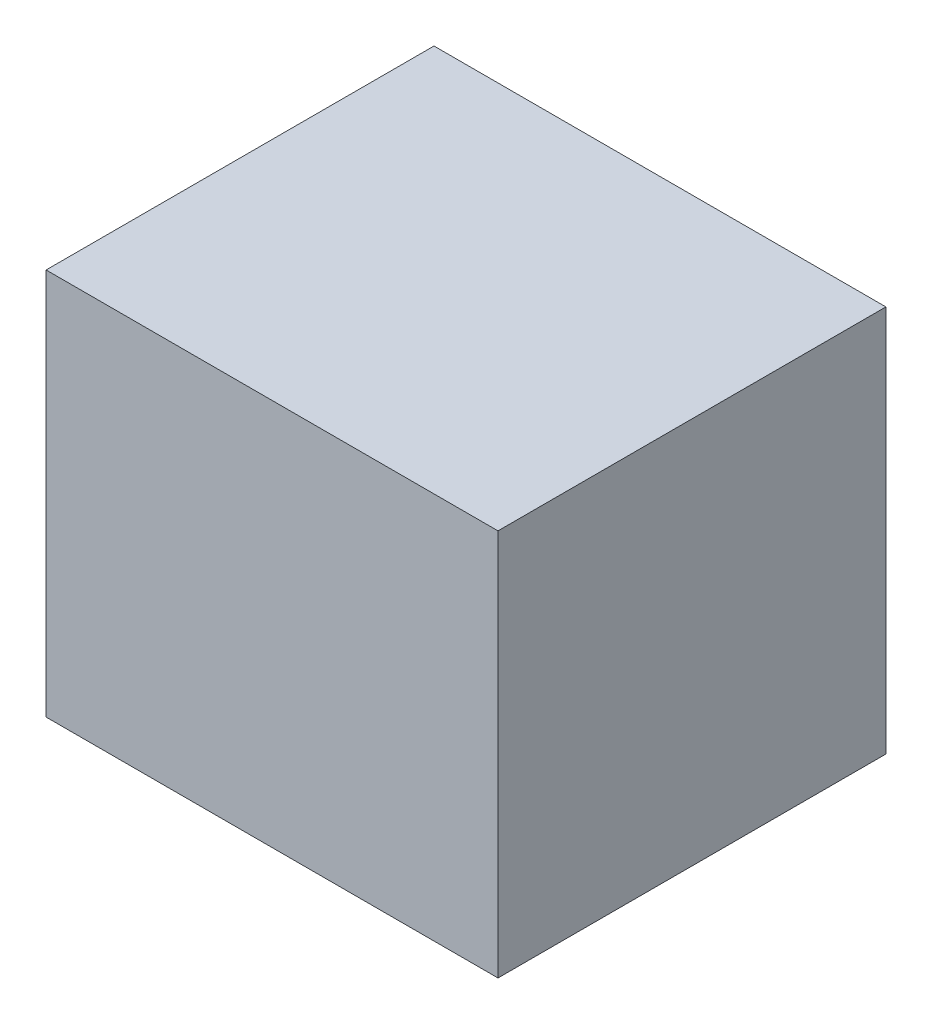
ISO-10303-21;
HEADER;
FILE_DESCRIPTION(('STEP AP214'),'2;1');
FILE_NAME('part.step','',(''),(''),'','','');
FILE_SCHEMA(('AUTOMOTIVE_DESIGN { 1 0 10303 214 1 1 1 1 }'));
ENDSEC;
DATA;
#1=APPLICATION_CONTEXT('core data for automotive mechanical design processes');
#2=APPLICATION_PROTOCOL_DEFINITION('international standard','automotive_design',2000,#1);
#3=PRODUCT_CONTEXT('',#1,'mechanical');
#4=PRODUCT('Part','Part','',(#3));
#5=PRODUCT_RELATED_PRODUCT_CATEGORY('part','',(#4));
#6=PRODUCT_DEFINITION_FORMATION('','',#4);
#7=PRODUCT_DEFINITION_CONTEXT('part definition',#1,'design');
#8=PRODUCT_DEFINITION('design','',#6,#7);
#9=PRODUCT_DEFINITION_SHAPE('','',#8);
#10=(LENGTH_UNIT() NAMED_UNIT(*) SI_UNIT(.MILLI.,.METRE.));
#11=(NAMED_UNIT(*) PLANE_ANGLE_UNIT() SI_UNIT($,.RADIAN.));
#12=(NAMED_UNIT(*) SI_UNIT($,.STERADIAN.) SOLID_ANGLE_UNIT());
#13=UNCERTAINTY_MEASURE_WITH_UNIT(LENGTH_MEASURE(1.E-05),#10,'distance_accuracy_value','');
#14=(GEOMETRIC_REPRESENTATION_CONTEXT(3) GLOBAL_UNCERTAINTY_ASSIGNED_CONTEXT((#13)) GLOBAL_UNIT_ASSIGNED_CONTEXT((#10,
#11,#12)) REPRESENTATION_CONTEXT('',''));
#15=CARTESIAN_POINT('',(0.,0.,0.));
#16=DIRECTION('',(0.,0.,1.));
#17=DIRECTION('',(1.,0.,0.));
#18=AXIS2_PLACEMENT_3D('',#15,#16,#17);
#19=CARTESIAN_POINT('',(0.,0.,0.5999988));
#20=DIRECTION('',(0.,0.,-1.));
#21=DIRECTION('',(0.,-1.,0.));
#22=AXIS2_PLACEMENT_3D('',#19,#20,#21);
#23=PLANE('',#22);
#24=DIRECTION('',(-1.,0.,0.));
#25=VECTOR('',#24,1.);
#26=CARTESIAN_POINT('',(0.34949384,-0.2994914,0.5999988));
#27=LINE('',#26,#25);
#28=CARTESIAN_POINT('',(0.34949384,-0.2994914,0.5999988));
#29=VERTEX_POINT('',#28);
#30=CARTESIAN_POINT('',(-0.34949384,-0.2994914,0.5999988));
#31=VERTEX_POINT('',#30);
#32=EDGE_CURVE('E25',#29,#31,#27,.T.);
#33=ORIENTED_EDGE('',*,*,#32,.F.);
#34=DIRECTION('',(0.,-1.,0.));
#35=VECTOR('',#34,1.);
#36=CARTESIAN_POINT('',(0.34949384,0.2994914,0.5999988));
#37=LINE('',#36,#35);
#38=CARTESIAN_POINT('',(0.34949384,0.2994914,0.5999988));
#39=VERTEX_POINT('',#38);
#40=EDGE_CURVE('E100',#39,#29,#37,.T.);
#41=ORIENTED_EDGE('',*,*,#40,.F.);
#42=DIRECTION('',(1.,0.,0.));
#43=VECTOR('',#42,1.);
#44=CARTESIAN_POINT('',(-0.34949384,0.2994914,0.5999988));
#45=LINE('',#44,#43);
#46=CARTESIAN_POINT('',(-0.34949384,0.2994914,0.5999988));
#47=VERTEX_POINT('',#46);
#48=EDGE_CURVE('E83',#47,#39,#45,.T.);
#49=ORIENTED_EDGE('',*,*,#48,.F.);
#50=DIRECTION('',(0.,1.,0.));
#51=VECTOR('',#50,1.);
#52=CARTESIAN_POINT('',(-0.34949384,-0.2994914,0.5999988));
#53=LINE('',#52,#51);
#54=EDGE_CURVE('E87',#31,#47,#53,.T.);
#55=ORIENTED_EDGE('',*,*,#54,.F.);
#56=EDGE_LOOP('',(#33,#41,#49,#55));
#57=FACE_BOUND('',#56,.T.);
#58=ADVANCED_FACE('F17',(#57),#23,.F.);
#59=CARTESIAN_POINT('',(0.,0.,0.));
#60=DIRECTION('',(0.,0.,-1.));
#61=DIRECTION('',(0.,-1.,0.));
#62=AXIS2_PLACEMENT_3D('',#59,#60,#61);
#63=PLANE('',#62);
#64=DIRECTION('',(0.,1.,0.));
#65=VECTOR('',#64,1.);
#66=CARTESIAN_POINT('',(-0.34949384,-0.2994914,0.));
#67=LINE('',#66,#65);
#68=CARTESIAN_POINT('',(-0.34949384,-0.2994914,0.));
#69=VERTEX_POINT('',#68);
#70=CARTESIAN_POINT('',(-0.34949384,0.2994914,0.));
#71=VERTEX_POINT('',#70);
#72=EDGE_CURVE('E71',#69,#71,#67,.T.);
#73=ORIENTED_EDGE('',*,*,#72,.T.);
#74=DIRECTION('',(1.,0.,0.));
#75=VECTOR('',#74,1.);
#76=CARTESIAN_POINT('',(-0.34949384,0.2994914,0.));
#77=LINE('',#76,#75);
#78=CARTESIAN_POINT('',(0.34949384,0.2994914,0.));
#79=VERTEX_POINT('',#78);
#80=EDGE_CURVE('E105',#71,#79,#77,.T.);
#81=ORIENTED_EDGE('',*,*,#80,.T.);
#82=DIRECTION('',(0.,-1.,0.));
#83=VECTOR('',#82,1.);
#84=CARTESIAN_POINT('',(0.34949384,0.2994914,0.));
#85=LINE('',#84,#83);
#86=CARTESIAN_POINT('',(0.34949384,-0.2994914,0.));
#87=VERTEX_POINT('',#86);
#88=EDGE_CURVE('E73',#79,#87,#85,.T.);
#89=ORIENTED_EDGE('',*,*,#88,.T.);
#90=DIRECTION('',(-1.,0.,0.));
#91=VECTOR('',#90,1.);
#92=CARTESIAN_POINT('',(0.34949384,-0.2994914,0.));
#93=LINE('',#92,#91);
#94=EDGE_CURVE('E11',#87,#69,#93,.T.);
#95=ORIENTED_EDGE('',*,*,#94,.T.);
#96=EDGE_LOOP('',(#73,#81,#89,#95));
#97=FACE_BOUND('',#96,.T.);
#98=ADVANCED_FACE('F69',(#97),#63,.T.);
#99=CARTESIAN_POINT('',(0.34949384,-0.2994914,0.));
#100=DIRECTION('',(0.,-1.,0.));
#101=DIRECTION('',(0.,0.,-1.));
#102=AXIS2_PLACEMENT_3D('',#99,#100,#101);
#103=PLANE('',#102);
#104=DIRECTION('',(0.,0.,1.));
#105=VECTOR('',#104,1.);
#106=CARTESIAN_POINT('',(0.34949384,-0.2994914,0.));
#107=LINE('',#106,#105);
#108=EDGE_CURVE('E104',#87,#29,#107,.T.);
#109=ORIENTED_EDGE('',*,*,#108,.T.);
#110=ORIENTED_EDGE('',*,*,#32,.T.);
#111=DIRECTION('',(0.,0.,1.));
#112=VECTOR('',#111,1.);
#113=CARTESIAN_POINT('',(-0.34949384,-0.2994914,0.));
#114=LINE('',#113,#112);
#115=EDGE_CURVE('E79',#69,#31,#114,.T.);
#116=ORIENTED_EDGE('',*,*,#115,.F.);
#117=ORIENTED_EDGE('',*,*,#94,.F.);
#118=EDGE_LOOP('',(#109,#110,#116,#117));
#119=FACE_BOUND('',#118,.T.);
#120=ADVANCED_FACE('F85',(#119),#103,.T.);
#121=CARTESIAN_POINT('',(0.34949384,0.2994914,0.));
#122=DIRECTION('',(1.,0.,0.));
#123=DIRECTION('',(0.,1.,0.));
#124=AXIS2_PLACEMENT_3D('',#121,#122,#123);
#125=PLANE('',#124);
#126=DIRECTION('',(0.,0.,1.));
#127=VECTOR('',#126,1.);
#128=CARTESIAN_POINT('',(0.34949384,0.2994914,0.));
#129=LINE('',#128,#127);
#130=EDGE_CURVE('E99',#79,#39,#129,.T.);
#131=ORIENTED_EDGE('',*,*,#130,.T.);
#132=ORIENTED_EDGE('',*,*,#40,.T.);
#133=ORIENTED_EDGE('',*,*,#108,.F.);
#134=ORIENTED_EDGE('',*,*,#88,.F.);
#135=EDGE_LOOP('',(#131,#132,#133,#134));
#136=FACE_BOUND('',#135,.T.);
#137=ADVANCED_FACE('F126',(#136),#125,.T.);
#138=CARTESIAN_POINT('',(-0.34949384,0.2994914,0.));
#139=DIRECTION('',(0.,1.,0.));
#140=DIRECTION('',(1.,0.,0.));
#141=AXIS2_PLACEMENT_3D('',#138,#139,#140);
#142=PLANE('',#141);
#143=DIRECTION('',(0.,0.,1.));
#144=VECTOR('',#143,1.);
#145=CARTESIAN_POINT('',(-0.34949384,0.2994914,0.));
#146=LINE('',#145,#144);
#147=EDGE_CURVE('E81',#71,#47,#146,.T.);
#148=ORIENTED_EDGE('',*,*,#147,.T.);
#149=ORIENTED_EDGE('',*,*,#48,.T.);
#150=ORIENTED_EDGE('',*,*,#130,.F.);
#151=ORIENTED_EDGE('',*,*,#80,.F.);
#152=EDGE_LOOP('',(#148,#149,#150,#151));
#153=FACE_BOUND('',#152,.T.);
#154=ADVANCED_FACE('F123',(#153),#142,.T.);
#155=CARTESIAN_POINT('',(-0.34949384,-0.2994914,0.));
#156=DIRECTION('',(-1.,0.,0.));
#157=DIRECTION('',(0.,0.,1.));
#158=AXIS2_PLACEMENT_3D('',#155,#156,#157);
#159=PLANE('',#158);
#160=ORIENTED_EDGE('',*,*,#115,.T.);
#161=ORIENTED_EDGE('',*,*,#54,.T.);
#162=ORIENTED_EDGE('',*,*,#147,.F.);
#163=ORIENTED_EDGE('',*,*,#72,.F.);
#164=EDGE_LOOP('',(#160,#161,#162,#163));
#165=FACE_BOUND('',#164,.T.);
#166=ADVANCED_FACE('F77',(#165),#159,.T.);
#167=CLOSED_SHELL('',(#58,#98,#120,#137,#154,#166));
#168=MANIFOLD_SOLID_BREP('B1',#167);
#169=ADVANCED_BREP_SHAPE_REPRESENTATION('',(#18,#168),#14);
#170=SHAPE_DEFINITION_REPRESENTATION(#9,#169);
ENDSEC;
END-ISO-10303-21;
